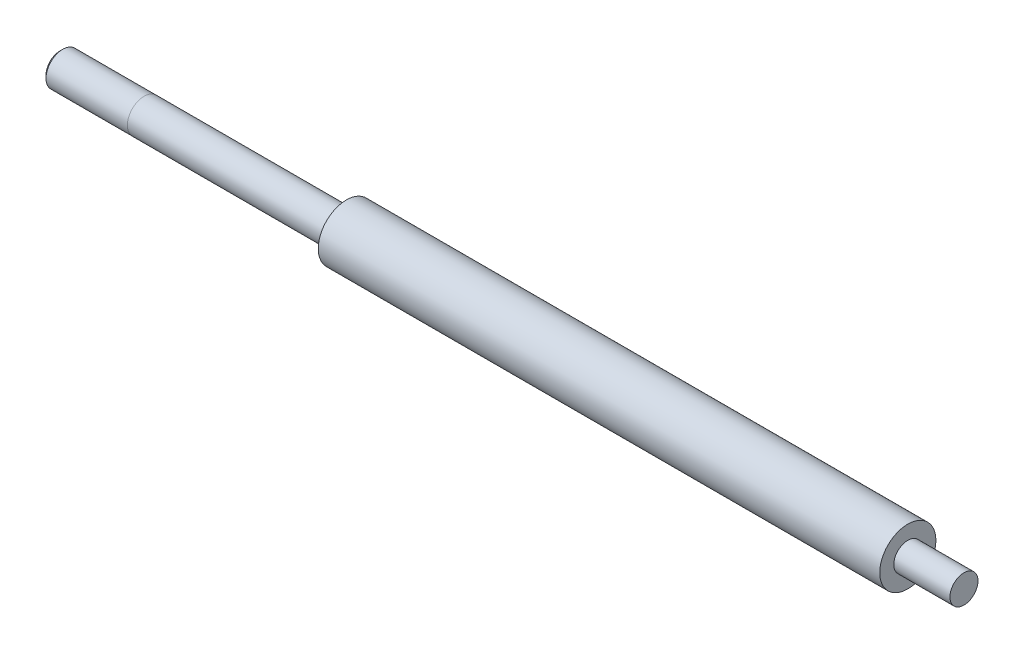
ISO-10303-21;
HEADER;
FILE_DESCRIPTION(('STEP AP214'),'2;1');
FILE_NAME('part.step','',(''),(''),'','','');
FILE_SCHEMA(('AUTOMOTIVE_DESIGN { 1 0 10303 214 1 1 1 1 }'));
ENDSEC;
DATA;
#1=APPLICATION_CONTEXT('core data for automotive mechanical design processes');
#2=APPLICATION_PROTOCOL_DEFINITION('international standard','automotive_design',2000,#1);
#3=PRODUCT_CONTEXT('',#1,'mechanical');
#4=PRODUCT('Part','Part','',(#3));
#5=PRODUCT_RELATED_PRODUCT_CATEGORY('part','',(#4));
#6=PRODUCT_DEFINITION_FORMATION('','',#4);
#7=PRODUCT_DEFINITION_CONTEXT('part definition',#1,'design');
#8=PRODUCT_DEFINITION('design','',#6,#7);
#9=PRODUCT_DEFINITION_SHAPE('','',#8);
#10=(LENGTH_UNIT() NAMED_UNIT(*) SI_UNIT(.MILLI.,.METRE.));
#11=(NAMED_UNIT(*) PLANE_ANGLE_UNIT() SI_UNIT($,.RADIAN.));
#12=(NAMED_UNIT(*) SI_UNIT($,.STERADIAN.) SOLID_ANGLE_UNIT());
#13=UNCERTAINTY_MEASURE_WITH_UNIT(LENGTH_MEASURE(1.E-05),#10,'distance_accuracy_value','');
#14=(GEOMETRIC_REPRESENTATION_CONTEXT(3) GLOBAL_UNCERTAINTY_ASSIGNED_CONTEXT((#13)) GLOBAL_UNIT_ASSIGNED_CONTEXT((#10,
#11,#12)) REPRESENTATION_CONTEXT('',''));
#15=CARTESIAN_POINT('',(0.,0.,0.));
#16=DIRECTION('',(0.,0.,1.));
#17=DIRECTION('',(1.,0.,0.));
#18=AXIS2_PLACEMENT_3D('',#15,#16,#17);
#19=CARTESIAN_POINT('',(-51.,0.,0.));
#20=DIRECTION('',(1.,0.,0.));
#21=DIRECTION('',(0.,0.,-1.));
#22=AXIS2_PLACEMENT_3D('',#19,#20,#21);
#23=CYLINDRICAL_SURFACE('',#22,3.);
#24=CARTESIAN_POINT('',(0.,0.,0.));
#25=DIRECTION('',(1.,0.,0.));
#26=DIRECTION('',(0.,0.,-1.));
#27=AXIS2_PLACEMENT_3D('',#24,#25,#26);
#28=CIRCLE('',#27,3.);
#29=CARTESIAN_POINT('',(0.,0.,-3.));
#30=VERTEX_POINT('',#29);
#31=EDGE_CURVE('E41',#30,#30,#28,.F.);
#32=ORIENTED_EDGE('',*,*,#31,.T.);
#33=EDGE_LOOP('',(#32));
#34=FACE_BOUND('',#33,.T.);
#35=CARTESIAN_POINT('',(-36.,0.,0.));
#36=DIRECTION('',(-1.,0.,0.));
#37=DIRECTION('',(0.,0.,1.));
#38=AXIS2_PLACEMENT_3D('',#35,#36,#37);
#39=CIRCLE('',#38,3.);
#40=CARTESIAN_POINT('',(-36.,0.,3.));
#41=VERTEX_POINT('',#40);
#42=EDGE_CURVE('E48',#41,#41,#39,.T.);
#43=ORIENTED_EDGE('',*,*,#42,.F.);
#44=EDGE_LOOP('',(#43));
#45=FACE_BOUND('',#44,.T.);
#46=ADVANCED_FACE('F30',(#34,#45),#23,.T.);
#47=CARTESIAN_POINT('',(0.,0.,0.));
#48=DIRECTION('',(1.,0.,0.));
#49=DIRECTION('',(0.,0.,-1.));
#50=AXIS2_PLACEMENT_3D('',#47,#48,#49);
#51=PLANE('',#50);
#52=CARTESIAN_POINT('',(0.,0.,0.));
#53=DIRECTION('',(1.,0.,0.));
#54=DIRECTION('',(0.,0.,-1.));
#55=AXIS2_PLACEMENT_3D('',#52,#53,#54);
#56=CIRCLE('',#55,5.);
#57=CARTESIAN_POINT('',(0.,0.,-5.));
#58=VERTEX_POINT('',#57);
#59=EDGE_CURVE('E55',#58,#58,#56,.T.);
#60=ORIENTED_EDGE('',*,*,#59,.F.);
#61=EDGE_LOOP('',(#60));
#62=FACE_BOUND('',#61,.T.);
#63=ORIENTED_EDGE('',*,*,#31,.F.);
#64=EDGE_LOOP('',(#63));
#65=FACE_BOUND('',#64,.T.);
#66=ADVANCED_FACE('F76',(#62,#65),#51,.F.);
#67=CARTESIAN_POINT('',(100.,0.,0.));
#68=DIRECTION('',(1.,0.,0.));
#69=DIRECTION('',(0.,0.,-1.));
#70=AXIS2_PLACEMENT_3D('',#67,#68,#69);
#71=PLANE('',#70);
#72=CARTESIAN_POINT('',(100.,0.,0.));
#73=DIRECTION('',(1.,0.,0.));
#74=DIRECTION('',(0.,0.,-1.));
#75=AXIS2_PLACEMENT_3D('',#72,#73,#74);
#76=CIRCLE('',#75,5.);
#77=CARTESIAN_POINT('',(100.,0.,-5.));
#78=VERTEX_POINT('',#77);
#79=EDGE_CURVE('E45',#78,#78,#76,.T.);
#80=ORIENTED_EDGE('',*,*,#79,.T.);
#81=EDGE_LOOP('',(#80));
#82=FACE_BOUND('',#81,.T.);
#83=CARTESIAN_POINT('',(100.,0.,0.));
#84=DIRECTION('',(1.,0.,0.));
#85=DIRECTION('',(0.,0.,-1.));
#86=AXIS2_PLACEMENT_3D('',#83,#84,#85);
#87=CIRCLE('',#86,2.5);
#88=CARTESIAN_POINT('',(100.,0.,-2.5));
#89=VERTEX_POINT('',#88);
#90=EDGE_CURVE('E50',#89,#89,#87,.T.);
#91=ORIENTED_EDGE('',*,*,#90,.F.);
#92=EDGE_LOOP('',(#91));
#93=FACE_BOUND('',#92,.T.);
#94=ADVANCED_FACE('F82',(#82,#93),#71,.T.);
#95=CARTESIAN_POINT('',(100.,0.,0.));
#96=DIRECTION('',(-1.,0.,0.));
#97=DIRECTION('',(0.,0.,1.));
#98=AXIS2_PLACEMENT_3D('',#95,#96,#97);
#99=CYLINDRICAL_SURFACE('',#98,5.);
#100=ORIENTED_EDGE('',*,*,#79,.F.);
#101=EDGE_LOOP('',(#100));
#102=FACE_BOUND('',#101,.T.);
#103=ORIENTED_EDGE('',*,*,#59,.T.);
#104=EDGE_LOOP('',(#103));
#105=FACE_BOUND('',#104,.T.);
#106=ADVANCED_FACE('F32',(#102,#105),#99,.T.);
#107=CARTESIAN_POINT('',(110.,0.,0.));
#108=DIRECTION('',(-1.,0.,0.));
#109=DIRECTION('',(0.,0.,1.));
#110=AXIS2_PLACEMENT_3D('',#107,#108,#109);
#111=CYLINDRICAL_SURFACE('',#110,2.5);
#112=CARTESIAN_POINT('',(110.,0.,0.));
#113=DIRECTION('',(1.,0.,0.));
#114=DIRECTION('',(0.,0.,-1.));
#115=AXIS2_PLACEMENT_3D('',#112,#113,#114);
#116=CIRCLE('',#115,2.5);
#117=CARTESIAN_POINT('',(110.,0.,-2.5));
#118=VERTEX_POINT('',#117);
#119=EDGE_CURVE('E58',#118,#118,#116,.T.);
#120=ORIENTED_EDGE('',*,*,#119,.F.);
#121=EDGE_LOOP('',(#120));
#122=FACE_BOUND('',#121,.T.);
#123=ORIENTED_EDGE('',*,*,#90,.T.);
#124=EDGE_LOOP('',(#123));
#125=FACE_BOUND('',#124,.T.);
#126=ADVANCED_FACE('F90',(#122,#125),#111,.T.);
#127=CARTESIAN_POINT('',(110.,0.,0.));
#128=DIRECTION('',(1.,0.,0.));
#129=DIRECTION('',(0.,0.,-1.));
#130=AXIS2_PLACEMENT_3D('',#127,#128,#129);
#131=PLANE('',#130);
#132=ORIENTED_EDGE('',*,*,#119,.T.);
#133=EDGE_LOOP('',(#132));
#134=FACE_BOUND('',#133,.T.);
#135=ADVANCED_FACE('F71',(#134),#131,.T.);
#136=CARTESIAN_POINT('',(-36.,0.,0.));
#137=DIRECTION('',(-1.,0.,0.));
#138=DIRECTION('',(0.,0.,1.));
#139=AXIS2_PLACEMENT_3D('',#136,#137,#138);
#140=PLANE('',#139);
#141=CARTESIAN_POINT('',(-36.,0.,0.));
#142=DIRECTION('',(-1.,0.,0.));
#143=DIRECTION('',(0.,0.,1.));
#144=AXIS2_PLACEMENT_3D('',#141,#142,#143);
#145=CIRCLE('',#144,2.99);
#146=CARTESIAN_POINT('',(-36.,0.,2.99));
#147=VERTEX_POINT('',#146);
#148=EDGE_CURVE('E51',#147,#147,#145,.T.);
#149=ORIENTED_EDGE('',*,*,#148,.F.);
#150=EDGE_LOOP('',(#149));
#151=FACE_BOUND('',#150,.T.);
#152=ORIENTED_EDGE('',*,*,#42,.T.);
#153=EDGE_LOOP('',(#152));
#154=FACE_BOUND('',#153,.T.);
#155=ADVANCED_FACE('F68',(#151,#154),#140,.T.);
#156=CARTESIAN_POINT('',(-36.,0.,0.));
#157=DIRECTION('',(-1.,0.,0.));
#158=DIRECTION('',(0.,0.,1.));
#159=AXIS2_PLACEMENT_3D('',#156,#157,#158);
#160=CYLINDRICAL_SURFACE('',#159,2.99);
#161=CARTESIAN_POINT('',(-50.5,0.,0.));
#162=DIRECTION('',(-1.,0.,0.));
#163=DIRECTION('',(0.,0.,1.));
#164=AXIS2_PLACEMENT_3D('',#161,#162,#163);
#165=CIRCLE('',#164,2.99);
#166=CARTESIAN_POINT('',(-50.5,0.,2.99));
#167=VERTEX_POINT('',#166);
#168=EDGE_CURVE('E10',#167,#167,#165,.F.);
#169=ORIENTED_EDGE('',*,*,#168,.T.);
#170=EDGE_LOOP('',(#169));
#171=FACE_BOUND('',#170,.T.);
#172=ORIENTED_EDGE('',*,*,#148,.T.);
#173=EDGE_LOOP('',(#172));
#174=FACE_BOUND('',#173,.T.);
#175=ADVANCED_FACE('F66',(#171,#174),#160,.T.);
#176=CARTESIAN_POINT('',(-51.,0.,0.));
#177=DIRECTION('',(-1.,0.,0.));
#178=DIRECTION('',(0.,0.,1.));
#179=AXIS2_PLACEMENT_3D('',#176,#177,#178);
#180=PLANE('',#179);
#181=CARTESIAN_POINT('',(-51.,0.,0.));
#182=DIRECTION('',(-1.,0.,0.));
#183=DIRECTION('',(0.,0.,1.));
#184=AXIS2_PLACEMENT_3D('',#181,#182,#183);
#185=CIRCLE('',#184,2.49000000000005);
#186=CARTESIAN_POINT('',(-51.,0.,2.49000000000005));
#187=VERTEX_POINT('',#186);
#188=EDGE_CURVE('E37',#187,#187,#185,.T.);
#189=ORIENTED_EDGE('',*,*,#188,.T.);
#190=EDGE_LOOP('',(#189));
#191=FACE_BOUND('',#190,.T.);
#192=ADVANCED_FACE('F87',(#191),#180,.T.);
#193=CARTESIAN_POINT('',(-51.,0.,0.));
#194=DIRECTION('',(1.,0.,0.));
#195=DIRECTION('',(0.,0.,-1.));
#196=AXIS2_PLACEMENT_3D('',#193,#194,#195);
#197=CONICAL_SURFACE('',#196,2.49000000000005,0.785398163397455);
#198=ORIENTED_EDGE('',*,*,#168,.F.);
#199=EDGE_LOOP('',(#198));
#200=FACE_BOUND('',#199,.T.);
#201=ORIENTED_EDGE('',*,*,#188,.F.);
#202=EDGE_LOOP('',(#201));
#203=FACE_BOUND('',#202,.T.);
#204=ADVANCED_FACE('F134',(#200,#203),#197,.T.);
#205=CLOSED_SHELL('',(#46,#66,#94,#106,#126,#135,#155,#175,#192,#204));
#206=MANIFOLD_SOLID_BREP('B2',#205);
#207=ADVANCED_BREP_SHAPE_REPRESENTATION('',(#18,#206),#14);
#208=SHAPE_DEFINITION_REPRESENTATION(#9,#207);
ENDSEC;
END-ISO-10303-21;
